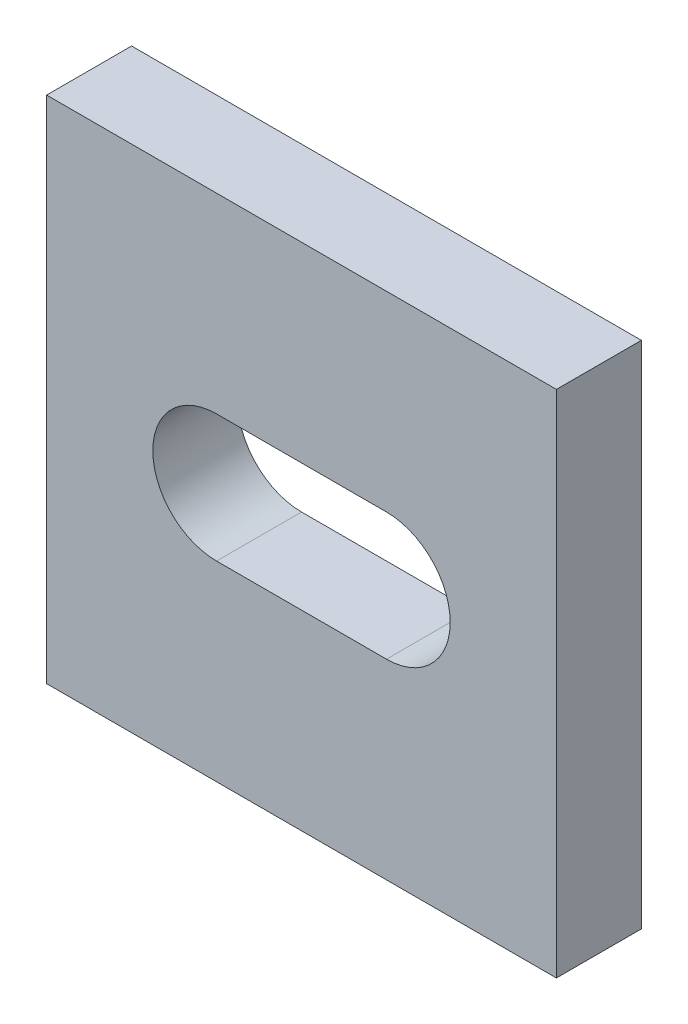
from build123d import *

# Parameters (mm, degrees)
SKIZZE1_W                       = 60
SKIZZE1_H                       = 60
AUFSATZ_LINEAR_AUSTRAGEN1_DEPTH = 10
SCHNITT_LINEAR_AUSTRAGEN1_DEPTH = 10


with BuildPart() as part:
    # Skizze1 → Aufsatz-Linear austragen1 (new body)
    with BuildSketch(Plane.XY):
        with Locations((30, 30)):
            Rectangle(SKIZZE1_W, SKIZZE1_H)
    extrude(amount=AUFSATZ_LINEAR_AUSTRAGEN1_DEPTH)

    # Skizze2 → Schnitt-Linear austragen1 (cut)
    with BuildSketch(Plane.XY.offset(10)):
        with BuildLine():
            Line((20, 37.5), (40, 37.5))
            ThreePointArc((40, 37.5), (47.5, 30), (40, 22.5))
            Line((40, 22.5), (20, 22.5))
            ThreePointArc((20, 22.5), (12.5, 30), (20, 37.5))
        make_face()
    extrude(amount=-SCHNITT_LINEAR_AUSTRAGEN1_DEPTH, mode=Mode.SUBTRACT)


solid = part.part
